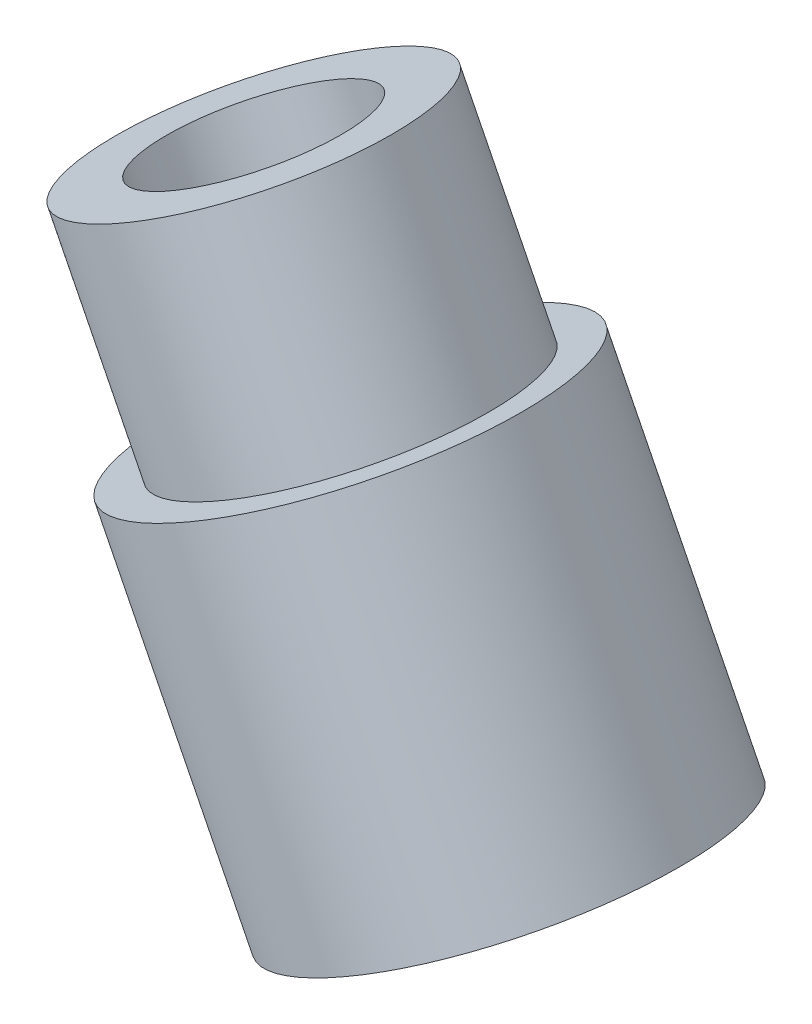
ISO-10303-21;
HEADER;
FILE_DESCRIPTION(('STEP AP214'),'2;1');
FILE_NAME('part.step','',(''),(''),'','','');
FILE_SCHEMA(('AUTOMOTIVE_DESIGN { 1 0 10303 214 1 1 1 1 }'));
ENDSEC;
DATA;
#1=APPLICATION_CONTEXT('core data for automotive mechanical design processes');
#2=APPLICATION_PROTOCOL_DEFINITION('international standard','automotive_design',2000,#1);
#3=PRODUCT_CONTEXT('',#1,'mechanical');
#4=PRODUCT('Part','Part','',(#3));
#5=PRODUCT_RELATED_PRODUCT_CATEGORY('part','',(#4));
#6=PRODUCT_DEFINITION_FORMATION('','',#4);
#7=PRODUCT_DEFINITION_CONTEXT('part definition',#1,'design');
#8=PRODUCT_DEFINITION('design','',#6,#7);
#9=PRODUCT_DEFINITION_SHAPE('','',#8);
#10=(LENGTH_UNIT() NAMED_UNIT(*) SI_UNIT(.MILLI.,.METRE.));
#11=(NAMED_UNIT(*) PLANE_ANGLE_UNIT() SI_UNIT($,.RADIAN.));
#12=(NAMED_UNIT(*) SI_UNIT($,.STERADIAN.) SOLID_ANGLE_UNIT());
#13=UNCERTAINTY_MEASURE_WITH_UNIT(LENGTH_MEASURE(1.E-05),#10,'distance_accuracy_value','');
#14=(GEOMETRIC_REPRESENTATION_CONTEXT(3) GLOBAL_UNCERTAINTY_ASSIGNED_CONTEXT((#13)) GLOBAL_UNIT_ASSIGNED_CONTEXT((#10,
#11,#12)) REPRESENTATION_CONTEXT('',''));
#15=CARTESIAN_POINT('',(0.,0.,0.));
#16=DIRECTION('',(0.,0.,1.));
#17=DIRECTION('',(1.,0.,0.));
#18=AXIS2_PLACEMENT_3D('',#15,#16,#17);
#19=CARTESIAN_POINT('',(11.4134571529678,54.2790522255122,0.));
#20=DIRECTION('',(0.449375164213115,-0.893343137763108,0.));
#21=DIRECTION('',(0.893343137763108,0.449375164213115,0.));
#22=AXIS2_PLACEMENT_3D('',#19,#20,#21);
#23=CYLINDRICAL_SURFACE('',#22,2.49999999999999);
#24=CARTESIAN_POINT('',(6.51593988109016,64.0151564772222,0.));
#25=DIRECTION('',(0.449375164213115,-0.893343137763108,0.));
#26=DIRECTION('',(0.893343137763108,0.449375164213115,0.));
#27=AXIS2_PLACEMENT_3D('',#24,#25,#26);
#28=CIRCLE('',#27,2.5);
#29=CARTESIAN_POINT('',(8.74929772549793,65.138594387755,0.));
#30=VERTEX_POINT('',#29);
#31=EDGE_CURVE('E388',#30,#30,#28,.T.);
#32=ORIENTED_EDGE('',*,*,#31,.T.);
#33=EDGE_LOOP('',(#32));
#34=FACE_BOUND('',#33,.T.);
#35=CARTESIAN_POINT('',(0.,76.9686319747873,0.));
#36=DIRECTION('',(0.449375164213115,-0.893343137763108,0.));
#37=DIRECTION('',(0.893343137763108,0.449375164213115,0.));
#38=AXIS2_PLACEMENT_3D('',#35,#36,#37);
#39=CIRCLE('',#38,2.49999999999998);
#40=CARTESIAN_POINT('',(2.23335784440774,78.0920698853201,0.));
#41=VERTEX_POINT('',#40);
#42=EDGE_CURVE('E10',#41,#41,#39,.T.);
#43=ORIENTED_EDGE('',*,*,#42,.F.);
#44=EDGE_LOOP('',(#43));
#45=FACE_BOUND('',#44,.T.);
#46=ADVANCED_FACE('F366',(#34,#45),#23,.F.);
#47=CARTESIAN_POINT('',(3.52283611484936,78.7407114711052,0.));
#48=DIRECTION('',(-0.449375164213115,0.893343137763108,0.));
#49=DIRECTION('',(-0.893343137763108,-0.449375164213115,0.));
#50=AXIS2_PLACEMENT_3D('',#47,#48,#49);
#51=PLANE('',#50);
#52=ORIENTED_EDGE('',*,*,#42,.T.);
#53=EDGE_LOOP('',(#52));
#54=FACE_BOUND('',#53,.T.);
#55=CARTESIAN_POINT('',(0.,76.9686319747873,0.));
#56=DIRECTION('',(0.449375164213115,-0.893343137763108,0.));
#57=DIRECTION('',(0.893343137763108,0.449375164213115,0.));
#58=AXIS2_PLACEMENT_3D('',#55,#56,#57);
#59=CIRCLE('',#58,3.9434299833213);
#60=CARTESIAN_POINT('',(3.52283611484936,78.7407114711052,0.));
#61=VERTEX_POINT('',#60);
#62=EDGE_CURVE('E372',#61,#61,#59,.T.);
#63=ORIENTED_EDGE('',*,*,#62,.F.);
#64=EDGE_LOOP('',(#63));
#65=FACE_BOUND('',#64,.T.);
#66=ADVANCED_FACE('F406',(#54,#65),#51,.T.);
#67=CARTESIAN_POINT('',(11.4134571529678,54.2790522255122,0.));
#68=DIRECTION('',(0.449375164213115,-0.893343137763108,0.));
#69=DIRECTION('',(0.893343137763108,0.449375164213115,0.));
#70=AXIS2_PLACEMENT_3D('',#67,#68,#69);
#71=CYLINDRICAL_SURFACE('',#70,3.9434299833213);
#72=ORIENTED_EDGE('',*,*,#62,.T.);
#73=EDGE_LOOP('',(#72));
#74=FACE_BOUND('',#73,.T.);
#75=CARTESIAN_POINT('',(2.47156340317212,72.0552447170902,0.));
#76=DIRECTION('',(0.449375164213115,-0.893343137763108,0.));
#77=DIRECTION('',(0.893343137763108,0.449375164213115,0.));
#78=AXIS2_PLACEMENT_3D('',#75,#76,#77);
#79=CIRCLE('',#78,3.94342998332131);
#80=CARTESIAN_POINT('',(5.9943995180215,73.8273242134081,0.));
#81=VERTEX_POINT('',#80);
#82=EDGE_CURVE('E376',#81,#81,#79,.T.);
#83=ORIENTED_EDGE('',*,*,#82,.F.);
#84=EDGE_LOOP('',(#83));
#85=FACE_BOUND('',#84,.T.);
#86=ADVANCED_FACE('F410',(#74,#85),#71,.T.);
#87=CARTESIAN_POINT('',(6.8413644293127,74.2533699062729,0.));
#88=DIRECTION('',(-0.449375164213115,0.893343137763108,0.));
#89=DIRECTION('',(-0.893343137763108,-0.449375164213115,0.));
#90=AXIS2_PLACEMENT_3D('',#87,#88,#89);
#91=PLANE('',#90);
#92=ORIENTED_EDGE('',*,*,#82,.T.);
#93=EDGE_LOOP('',(#92));
#94=FACE_BOUND('',#93,.T.);
#95=CARTESIAN_POINT('',(2.47156340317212,72.0552447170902,0.));
#96=DIRECTION('',(0.449375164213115,-0.893343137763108,0.));
#97=DIRECTION('',(0.893343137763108,0.449375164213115,0.));
#98=AXIS2_PLACEMENT_3D('',#95,#96,#97);
#99=CIRCLE('',#98,4.89151462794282);
#100=CARTESIAN_POINT('',(6.8413644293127,74.2533699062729,0.));
#101=VERTEX_POINT('',#100);
#102=EDGE_CURVE('E380',#101,#101,#99,.T.);
#103=ORIENTED_EDGE('',*,*,#102,.F.);
#104=EDGE_LOOP('',(#103));
#105=FACE_BOUND('',#104,.T.);
#106=ADVANCED_FACE('F402',(#94,#105),#91,.T.);
#107=CARTESIAN_POINT('',(11.4134571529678,54.2790522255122,0.));
#108=DIRECTION('',(0.449375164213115,-0.893343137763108,0.));
#109=DIRECTION('',(0.893343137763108,0.449375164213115,0.));
#110=AXIS2_PLACEMENT_3D('',#107,#108,#109);
#111=CYLINDRICAL_SURFACE('',#110,4.89151462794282);
#112=ORIENTED_EDGE('',*,*,#102,.T.);
#113=EDGE_LOOP('',(#112));
#114=FACE_BOUND('',#113,.T.);
#115=CARTESIAN_POINT('',(6.51593988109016,64.0151564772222,0.));
#116=DIRECTION('',(0.449375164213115,-0.893343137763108,0.));
#117=DIRECTION('',(0.893343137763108,0.449375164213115,0.));
#118=AXIS2_PLACEMENT_3D('',#115,#116,#117);
#119=CIRCLE('',#118,4.89151462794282);
#120=CARTESIAN_POINT('',(10.8857409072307,66.2132816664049,0.));
#121=VERTEX_POINT('',#120);
#122=EDGE_CURVE('E385',#121,#121,#119,.T.);
#123=ORIENTED_EDGE('',*,*,#122,.F.);
#124=EDGE_LOOP('',(#123));
#125=FACE_BOUND('',#124,.T.);
#126=ADVANCED_FACE('F396',(#114,#125),#111,.T.);
#127=CARTESIAN_POINT('',(8.74929772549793,65.138594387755,0.));
#128=DIRECTION('',(0.449375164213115,-0.893343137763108,0.));
#129=DIRECTION('',(0.893343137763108,0.449375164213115,0.));
#130=AXIS2_PLACEMENT_3D('',#127,#128,#129);
#131=PLANE('',#130);
#132=ORIENTED_EDGE('',*,*,#122,.T.);
#133=EDGE_LOOP('',(#132));
#134=FACE_BOUND('',#133,.T.);
#135=ORIENTED_EDGE('',*,*,#31,.F.);
#136=EDGE_LOOP('',(#135));
#137=FACE_BOUND('',#136,.T.);
#138=ADVANCED_FACE('F394',(#134,#137),#131,.T.);
#139=CLOSED_SHELL('',(#46,#66,#86,#106,#126,#138));
#140=MANIFOLD_SOLID_BREP('B2',#139);
#141=ADVANCED_BREP_SHAPE_REPRESENTATION('',(#18,#140),#14);
#142=SHAPE_DEFINITION_REPRESENTATION(#9,#141);
ENDSEC;
END-ISO-10303-21;
